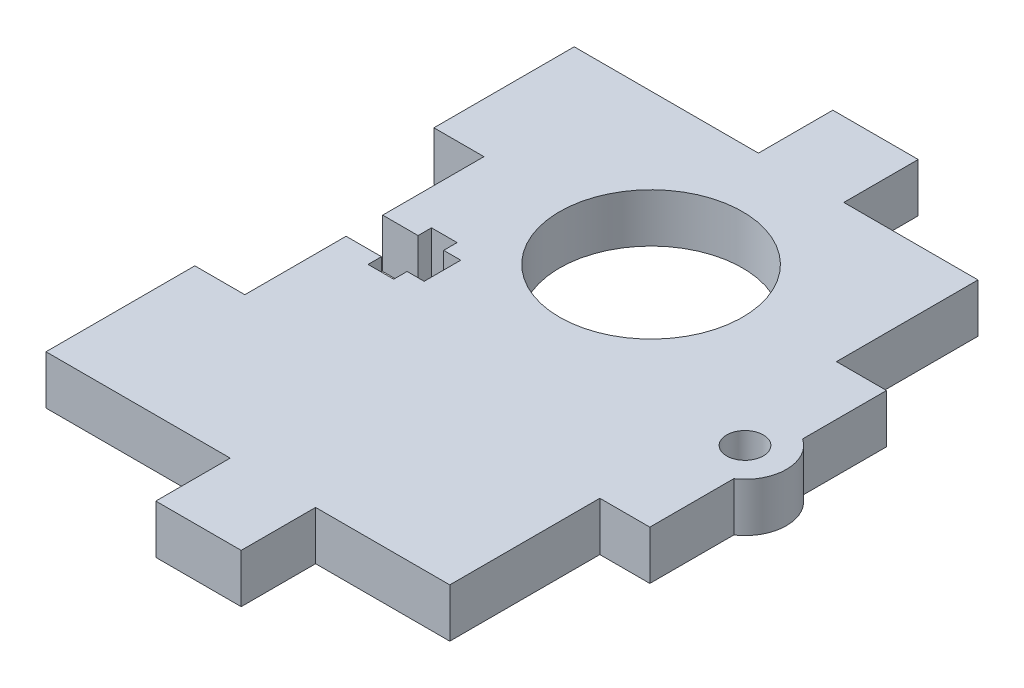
ISO-10303-21;
HEADER;
FILE_DESCRIPTION(('STEP AP214'),'2;1');
FILE_NAME('part.step','',(''),(''),'','','');
FILE_SCHEMA(('AUTOMOTIVE_DESIGN { 1 0 10303 214 1 1 1 1 }'));
ENDSEC;
DATA;
#1=APPLICATION_CONTEXT('core data for automotive mechanical design processes');
#2=APPLICATION_PROTOCOL_DEFINITION('international standard','automotive_design',2000,#1);
#3=PRODUCT_CONTEXT('',#1,'mechanical');
#4=PRODUCT('Part','Part','',(#3));
#5=PRODUCT_RELATED_PRODUCT_CATEGORY('part','',(#4));
#6=PRODUCT_DEFINITION_FORMATION('','',#4);
#7=PRODUCT_DEFINITION_CONTEXT('part definition',#1,'design');
#8=PRODUCT_DEFINITION('design','',#6,#7);
#9=PRODUCT_DEFINITION_SHAPE('','',#8);
#10=(LENGTH_UNIT() NAMED_UNIT(*) SI_UNIT(.MILLI.,.METRE.));
#11=(NAMED_UNIT(*) PLANE_ANGLE_UNIT() SI_UNIT($,.RADIAN.));
#12=(NAMED_UNIT(*) SI_UNIT($,.STERADIAN.) SOLID_ANGLE_UNIT());
#13=UNCERTAINTY_MEASURE_WITH_UNIT(LENGTH_MEASURE(1.E-05),#10,'distance_accuracy_value','');
#14=(GEOMETRIC_REPRESENTATION_CONTEXT(3) GLOBAL_UNCERTAINTY_ASSIGNED_CONTEXT((#13)) GLOBAL_UNIT_ASSIGNED_CONTEXT((#10,
#11,#12)) REPRESENTATION_CONTEXT('',''));
#15=CARTESIAN_POINT('',(0.,0.,0.));
#16=DIRECTION('',(0.,0.,1.));
#17=DIRECTION('',(1.,0.,0.));
#18=AXIS2_PLACEMENT_3D('',#15,#16,#17);
#19=CARTESIAN_POINT('',(-9.5,-2.,-2.6));
#20=DIRECTION('',(-1.,0.,0.));
#21=DIRECTION('',(0.,0.,1.));
#22=AXIS2_PLACEMENT_3D('',#19,#20,#21);
#23=PLANE('',#22);
#24=DIRECTION('',(0.,1.,0.));
#25=VECTOR('',#24,1.);
#26=CARTESIAN_POINT('',(-9.5,-2.,-2.6));
#27=LINE('',#26,#25);
#28=CARTESIAN_POINT('',(-9.5,-2.,-2.6));
#29=VERTEX_POINT('',#28);
#30=CARTESIAN_POINT('',(-9.5,2.,-2.6));
#31=VERTEX_POINT('',#30);
#32=EDGE_CURVE('E481',#29,#31,#27,.T.);
#33=ORIENTED_EDGE('',*,*,#32,.F.);
#34=DIRECTION('',(0.,0.,1.));
#35=VECTOR('',#34,1.);
#36=CARTESIAN_POINT('',(-9.5,-2.,-2.6));
#37=LINE('',#36,#35);
#38=CARTESIAN_POINT('',(-9.5,-2.,-1.5));
#39=VERTEX_POINT('',#38);
#40=EDGE_CURVE('E617',#29,#39,#37,.T.);
#41=ORIENTED_EDGE('',*,*,#40,.T.);
#42=DIRECTION('',(0.,1.,0.));
#43=VECTOR('',#42,1.);
#44=CARTESIAN_POINT('',(-9.5,-2.,-1.5));
#45=LINE('',#44,#43);
#46=CARTESIAN_POINT('',(-9.5,2.,-1.5));
#47=VERTEX_POINT('',#46);
#48=EDGE_CURVE('E607',#47,#39,#45,.F.);
#49=ORIENTED_EDGE('',*,*,#48,.F.);
#50=DIRECTION('',(0.,0.,1.));
#51=VECTOR('',#50,1.);
#52=CARTESIAN_POINT('',(-9.5,2.,0.));
#53=LINE('',#52,#51);
#54=EDGE_CURVE('E518',#31,#47,#53,.T.);
#55=ORIENTED_EDGE('',*,*,#54,.F.);
#56=EDGE_LOOP('',(#33,#41,#49,#55));
#57=FACE_BOUND('',#56,.T.);
#58=ADVANCED_FACE('F17',(#57),#23,.T.);
#59=CARTESIAN_POINT('',(-11.6,-2.,-1.5));
#60=DIRECTION('',(1.,0.,0.));
#61=DIRECTION('',(0.,0.,-1.));
#62=AXIS2_PLACEMENT_3D('',#59,#60,#61);
#63=PLANE('',#62);
#64=DIRECTION('',(0.,1.,0.));
#65=VECTOR('',#64,1.);
#66=CARTESIAN_POINT('',(-11.6,-2.,-1.5));
#67=LINE('',#66,#65);
#68=CARTESIAN_POINT('',(-11.6,-2.,-1.5));
#69=VERTEX_POINT('',#68);
#70=CARTESIAN_POINT('',(-11.6,2.,-1.5));
#71=VERTEX_POINT('',#70);
#72=EDGE_CURVE('E490',#69,#71,#67,.T.);
#73=ORIENTED_EDGE('',*,*,#72,.F.);
#74=DIRECTION('',(0.,0.,-1.));
#75=VECTOR('',#74,1.);
#76=CARTESIAN_POINT('',(-11.6,-2.,-1.5));
#77=LINE('',#76,#75);
#78=CARTESIAN_POINT('',(-11.6,-2.,-2.6));
#79=VERTEX_POINT('',#78);
#80=EDGE_CURVE('E614',#69,#79,#77,.T.);
#81=ORIENTED_EDGE('',*,*,#80,.T.);
#82=DIRECTION('',(0.,1.,0.));
#83=VECTOR('',#82,1.);
#84=CARTESIAN_POINT('',(-11.6,-2.,-2.6));
#85=LINE('',#84,#83);
#86=CARTESIAN_POINT('',(-11.6,2.,-2.6));
#87=VERTEX_POINT('',#86);
#88=EDGE_CURVE('E473',#87,#79,#85,.F.);
#89=ORIENTED_EDGE('',*,*,#88,.F.);
#90=DIRECTION('',(0.,0.,1.));
#91=VECTOR('',#90,1.);
#92=CARTESIAN_POINT('',(-11.6,2.,0.));
#93=LINE('',#92,#91);
#94=EDGE_CURVE('E521',#71,#87,#93,.F.);
#95=ORIENTED_EDGE('',*,*,#94,.F.);
#96=EDGE_LOOP('',(#73,#81,#89,#95));
#97=FACE_BOUND('',#96,.T.);
#98=ADVANCED_FACE('F1061',(#97),#63,.T.);
#99=CARTESIAN_POINT('',(-8.1,-2.,1.5));
#100=DIRECTION('',(0.,0.,-1.));
#101=DIRECTION('',(-1.,0.,0.));
#102=AXIS2_PLACEMENT_3D('',#99,#100,#101);
#103=PLANE('',#102);
#104=DIRECTION('',(0.,1.,0.));
#105=VECTOR('',#104,1.);
#106=CARTESIAN_POINT('',(-8.1,-2.,1.5));
#107=LINE('',#106,#105);
#108=CARTESIAN_POINT('',(-8.1,-2.,1.5));
#109=VERTEX_POINT('',#108);
#110=CARTESIAN_POINT('',(-8.1,2.,1.5));
#111=VERTEX_POINT('',#110);
#112=EDGE_CURVE('E470',#109,#111,#107,.T.);
#113=ORIENTED_EDGE('',*,*,#112,.F.);
#114=DIRECTION('',(-1.,0.,0.));
#115=VECTOR('',#114,1.);
#116=CARTESIAN_POINT('',(-8.1,-2.,1.5));
#117=LINE('',#116,#115);
#118=CARTESIAN_POINT('',(-9.5,-2.,1.5));
#119=VERTEX_POINT('',#118);
#120=EDGE_CURVE('E611',#109,#119,#117,.T.);
#121=ORIENTED_EDGE('',*,*,#120,.T.);
#122=DIRECTION('',(0.,1.,0.));
#123=VECTOR('',#122,1.);
#124=CARTESIAN_POINT('',(-9.5,-2.,1.5));
#125=LINE('',#124,#123);
#126=CARTESIAN_POINT('',(-9.5,2.,1.5));
#127=VERTEX_POINT('',#126);
#128=EDGE_CURVE('E600',#127,#119,#125,.F.);
#129=ORIENTED_EDGE('',*,*,#128,.F.);
#130=DIRECTION('',(1.,0.,0.));
#131=VECTOR('',#130,1.);
#132=CARTESIAN_POINT('',(0.,2.,1.5));
#133=LINE('',#132,#131);
#134=EDGE_CURVE('E512',#111,#127,#133,.F.);
#135=ORIENTED_EDGE('',*,*,#134,.F.);
#136=EDGE_LOOP('',(#113,#121,#129,#135));
#137=FACE_BOUND('',#136,.T.);
#138=ADVANCED_FACE('F1053',(#137),#103,.T.);
#139=CARTESIAN_POINT('',(-9.5,-2.,-1.5));
#140=DIRECTION('',(0.,0.,1.));
#141=DIRECTION('',(1.,0.,0.));
#142=AXIS2_PLACEMENT_3D('',#139,#140,#141);
#143=PLANE('',#142);
#144=ORIENTED_EDGE('',*,*,#48,.T.);
#145=DIRECTION('',(1.,0.,0.));
#146=VECTOR('',#145,1.);
#147=CARTESIAN_POINT('',(-9.5,-2.,-1.5));
#148=LINE('',#147,#146);
#149=CARTESIAN_POINT('',(-8.1,-2.,-1.5));
#150=VERTEX_POINT('',#149);
#151=EDGE_CURVE('E604',#39,#150,#148,.T.);
#152=ORIENTED_EDGE('',*,*,#151,.T.);
#153=DIRECTION('',(0.,1.,0.));
#154=VECTOR('',#153,1.);
#155=CARTESIAN_POINT('',(-8.1,-2.,-1.5));
#156=LINE('',#155,#154);
#157=CARTESIAN_POINT('',(-8.1,2.,-1.5));
#158=VERTEX_POINT('',#157);
#159=EDGE_CURVE('E461',#158,#150,#156,.F.);
#160=ORIENTED_EDGE('',*,*,#159,.F.);
#161=DIRECTION('',(1.,0.,0.));
#162=VECTOR('',#161,1.);
#163=CARTESIAN_POINT('',(0.,2.,-1.5));
#164=LINE('',#163,#162);
#165=EDGE_CURVE('E515',#47,#158,#164,.T.);
#166=ORIENTED_EDGE('',*,*,#165,.F.);
#167=EDGE_LOOP('',(#144,#152,#160,#166));
#168=FACE_BOUND('',#167,.T.);
#169=ADVANCED_FACE('F1045',(#168),#143,.T.);
#170=CARTESIAN_POINT('',(-9.5,-2.,1.5));
#171=DIRECTION('',(-1.,0.,0.));
#172=DIRECTION('',(0.,0.,1.));
#173=AXIS2_PLACEMENT_3D('',#170,#171,#172);
#174=PLANE('',#173);
#175=ORIENTED_EDGE('',*,*,#128,.T.);
#176=DIRECTION('',(0.,0.,1.));
#177=VECTOR('',#176,1.);
#178=CARTESIAN_POINT('',(-9.5,-2.,1.5));
#179=LINE('',#178,#177);
#180=CARTESIAN_POINT('',(-9.5,-2.,2.6));
#181=VERTEX_POINT('',#180);
#182=EDGE_CURVE('E591',#119,#181,#179,.T.);
#183=ORIENTED_EDGE('',*,*,#182,.T.);
#184=DIRECTION('',(0.,1.,0.));
#185=VECTOR('',#184,1.);
#186=CARTESIAN_POINT('',(-9.5,-2.,2.6));
#187=LINE('',#186,#185);
#188=CARTESIAN_POINT('',(-9.5,2.,2.6));
#189=VERTEX_POINT('',#188);
#190=EDGE_CURVE('E456',#189,#181,#187,.F.);
#191=ORIENTED_EDGE('',*,*,#190,.F.);
#192=DIRECTION('',(0.,0.,1.));
#193=VECTOR('',#192,1.);
#194=CARTESIAN_POINT('',(-9.5,2.,0.));
#195=LINE('',#194,#193);
#196=EDGE_CURVE('E509',#127,#189,#195,.T.);
#197=ORIENTED_EDGE('',*,*,#196,.F.);
#198=EDGE_LOOP('',(#175,#183,#191,#197));
#199=FACE_BOUND('',#198,.T.);
#200=ADVANCED_FACE('F1037',(#199),#174,.T.);
#201=CARTESIAN_POINT('',(-11.6,-2.,2.6));
#202=DIRECTION('',(1.,0.,0.));
#203=DIRECTION('',(0.,0.,-1.));
#204=AXIS2_PLACEMENT_3D('',#201,#202,#203);
#205=PLANE('',#204);
#206=DIRECTION('',(0.,1.,0.));
#207=VECTOR('',#206,1.);
#208=CARTESIAN_POINT('',(-11.6,-2.,2.6));
#209=LINE('',#208,#207);
#210=CARTESIAN_POINT('',(-11.6,-2.,2.6));
#211=VERTEX_POINT('',#210);
#212=CARTESIAN_POINT('',(-11.6,2.,2.6));
#213=VERTEX_POINT('',#212);
#214=EDGE_CURVE('E465',#211,#213,#209,.T.);
#215=ORIENTED_EDGE('',*,*,#214,.F.);
#216=DIRECTION('',(0.,0.,-1.));
#217=VECTOR('',#216,1.);
#218=CARTESIAN_POINT('',(-11.6,-2.,2.6));
#219=LINE('',#218,#217);
#220=CARTESIAN_POINT('',(-11.6,-2.,1.5));
#221=VERTEX_POINT('',#220);
#222=EDGE_CURVE('E523',#211,#221,#219,.T.);
#223=ORIENTED_EDGE('',*,*,#222,.T.);
#224=DIRECTION('',(0.,1.,0.));
#225=VECTOR('',#224,1.);
#226=CARTESIAN_POINT('',(-11.6,-2.,1.5));
#227=LINE('',#226,#225);
#228=CARTESIAN_POINT('',(-11.6,2.,1.5));
#229=VERTEX_POINT('',#228);
#230=EDGE_CURVE('E449',#229,#221,#227,.F.);
#231=ORIENTED_EDGE('',*,*,#230,.F.);
#232=DIRECTION('',(0.,0.,1.));
#233=VECTOR('',#232,1.);
#234=CARTESIAN_POINT('',(-11.6,2.,0.));
#235=LINE('',#234,#233);
#236=EDGE_CURVE('E508',#213,#229,#235,.F.);
#237=ORIENTED_EDGE('',*,*,#236,.F.);
#238=EDGE_LOOP('',(#215,#223,#231,#237));
#239=FACE_BOUND('',#238,.T.);
#240=ADVANCED_FACE('F1029',(#239),#205,.T.);
#241=CARTESIAN_POINT('',(0.,2.,0.));
#242=DIRECTION('',(0.,1.,0.));
#243=DIRECTION('',(0.,0.,1.));
#244=AXIS2_PLACEMENT_3D('',#241,#242,#243);
#245=PLANE('',#244);
#246=CARTESIAN_POINT('',(0.,2.,-9.));
#247=DIRECTION('',(0.,1.,0.));
#248=DIRECTION('',(0.,0.,1.));
#249=AXIS2_PLACEMENT_3D('',#246,#247,#248);
#250=CIRCLE('',#249,7.5);
#251=CARTESIAN_POINT('',(0.,2.,-1.5));
#252=VERTEX_POINT('',#251);
#253=EDGE_CURVE('E641',#252,#252,#250,.F.);
#254=ORIENTED_EDGE('',*,*,#253,.T.);
#255=EDGE_LOOP('',(#254));
#256=FACE_BOUND('',#255,.T.);
#257=CARTESIAN_POINT('',(16.7,2.,0.));
#258=DIRECTION('',(0.,1.,0.));
#259=DIRECTION('',(0.,0.,1.));
#260=AXIS2_PLACEMENT_3D('',#257,#258,#259);
#261=CIRCLE('',#260,1.5);
#262=CARTESIAN_POINT('',(16.7,2.,1.5));
#263=VERTEX_POINT('',#262);
#264=EDGE_CURVE('E645',#263,#263,#261,.F.);
#265=ORIENTED_EDGE('',*,*,#264,.T.);
#266=EDGE_LOOP('',(#265));
#267=FACE_BOUND('',#266,.T.);
#268=DIRECTION('',(-1.,0.,0.));
#269=VECTOR('',#268,1.);
#270=CARTESIAN_POINT('',(-3.5,2.,-21.3));
#271=LINE('',#270,#269);
#272=CARTESIAN_POINT('',(-18.6,2.,-21.3));
#273=VERTEX_POINT('',#272);
#274=CARTESIAN_POINT('',(-3.5,2.,-21.3));
#275=VERTEX_POINT('',#274);
#276=EDGE_CURVE('E653',#273,#275,#271,.F.);
#277=ORIENTED_EDGE('',*,*,#276,.F.);
#278=DIRECTION('',(0.,0.,1.));
#279=VECTOR('',#278,1.);
#280=CARTESIAN_POINT('',(-18.6,2.,-21.3));
#281=LINE('',#280,#279);
#282=CARTESIAN_POINT('',(-18.6,2.,-9.8));
#283=VERTEX_POINT('',#282);
#284=EDGE_CURVE('E505',#283,#273,#281,.F.);
#285=ORIENTED_EDGE('',*,*,#284,.F.);
#286=DIRECTION('',(1.,0.,0.));
#287=VECTOR('',#286,1.);
#288=CARTESIAN_POINT('',(-18.6,2.,-9.8));
#289=LINE('',#288,#287);
#290=CARTESIAN_POINT('',(-14.5,2.,-9.8));
#291=VERTEX_POINT('',#290);
#292=EDGE_CURVE('E502',#291,#283,#289,.F.);
#293=ORIENTED_EDGE('',*,*,#292,.F.);
#294=DIRECTION('',(0.,0.,1.));
#295=VECTOR('',#294,1.);
#296=CARTESIAN_POINT('',(-14.5,2.,-9.8));
#297=LINE('',#296,#295);
#298=CARTESIAN_POINT('',(-14.5,2.,-1.5));
#299=VERTEX_POINT('',#298);
#300=EDGE_CURVE('E496',#299,#291,#297,.F.);
#301=ORIENTED_EDGE('',*,*,#300,.F.);
#302=DIRECTION('',(1.,0.,0.));
#303=VECTOR('',#302,1.);
#304=CARTESIAN_POINT('',(-14.5,2.,-1.5));
#305=LINE('',#304,#303);
#306=EDGE_CURVE('E487',#71,#299,#305,.F.);
#307=ORIENTED_EDGE('',*,*,#306,.F.);
#308=ORIENTED_EDGE('',*,*,#94,.T.);
#309=DIRECTION('',(1.,0.,0.));
#310=VECTOR('',#309,1.);
#311=CARTESIAN_POINT('',(-11.6,2.,-2.6));
#312=LINE('',#311,#310);
#313=EDGE_CURVE('E477',#31,#87,#312,.F.);
#314=ORIENTED_EDGE('',*,*,#313,.F.);
#315=ORIENTED_EDGE('',*,*,#54,.T.);
#316=ORIENTED_EDGE('',*,*,#165,.T.);
#317=DIRECTION('',(0.,0.,1.));
#318=VECTOR('',#317,1.);
#319=CARTESIAN_POINT('',(-8.1,2.,-1.5));
#320=LINE('',#319,#318);
#321=EDGE_CURVE('E466',#111,#158,#320,.F.);
#322=ORIENTED_EDGE('',*,*,#321,.F.);
#323=ORIENTED_EDGE('',*,*,#134,.T.);
#324=ORIENTED_EDGE('',*,*,#196,.T.);
#325=DIRECTION('',(-1.,0.,0.));
#326=VECTOR('',#325,1.);
#327=CARTESIAN_POINT('',(-9.5,2.,2.6));
#328=LINE('',#327,#326);
#329=EDGE_CURVE('E460',#213,#189,#328,.F.);
#330=ORIENTED_EDGE('',*,*,#329,.F.);
#331=ORIENTED_EDGE('',*,*,#236,.T.);
#332=DIRECTION('',(-1.,0.,0.));
#333=VECTOR('',#332,1.);
#334=CARTESIAN_POINT('',(-11.6,2.,1.5));
#335=LINE('',#334,#333);
#336=CARTESIAN_POINT('',(-14.5,2.,1.5));
#337=VERTEX_POINT('',#336);
#338=EDGE_CURVE('E453',#337,#229,#335,.F.);
#339=ORIENTED_EDGE('',*,*,#338,.F.);
#340=DIRECTION('',(0.,0.,1.));
#341=VECTOR('',#340,1.);
#342=CARTESIAN_POINT('',(-14.5,2.,1.5));
#343=LINE('',#342,#341);
#344=CARTESIAN_POINT('',(-14.5,2.,9.8));
#345=VERTEX_POINT('',#344);
#346=EDGE_CURVE('E440',#345,#337,#343,.F.);
#347=ORIENTED_EDGE('',*,*,#346,.F.);
#348=DIRECTION('',(-1.,0.,0.));
#349=VECTOR('',#348,1.);
#350=CARTESIAN_POINT('',(-14.5,2.,9.8));
#351=LINE('',#350,#349);
#352=CARTESIAN_POINT('',(-18.6,2.,9.8));
#353=VERTEX_POINT('',#352);
#354=EDGE_CURVE('E428',#353,#345,#351,.F.);
#355=ORIENTED_EDGE('',*,*,#354,.F.);
#356=DIRECTION('',(0.,0.,1.));
#357=VECTOR('',#356,1.);
#358=CARTESIAN_POINT('',(-18.6,2.,9.8));
#359=LINE('',#358,#357);
#360=CARTESIAN_POINT('',(-18.6,2.,22.));
#361=VERTEX_POINT('',#360);
#362=EDGE_CURVE('E416',#361,#353,#359,.F.);
#363=ORIENTED_EDGE('',*,*,#362,.F.);
#364=DIRECTION('',(1.,0.,0.));
#365=VECTOR('',#364,1.);
#366=CARTESIAN_POINT('',(-18.6,2.,22.));
#367=LINE('',#366,#365);
#368=CARTESIAN_POINT('',(-3.5,2.,22.));
#369=VERTEX_POINT('',#368);
#370=EDGE_CURVE('E404',#369,#361,#367,.F.);
#371=ORIENTED_EDGE('',*,*,#370,.F.);
#372=DIRECTION('',(0.,0.,1.));
#373=VECTOR('',#372,1.);
#374=CARTESIAN_POINT('',(-3.5,2.,22.));
#375=LINE('',#374,#373);
#376=CARTESIAN_POINT('',(-3.5,2.,28.1));
#377=VERTEX_POINT('',#376);
#378=EDGE_CURVE('E392',#377,#369,#375,.F.);
#379=ORIENTED_EDGE('',*,*,#378,.F.);
#380=DIRECTION('',(1.,0.,0.));
#381=VECTOR('',#380,1.);
#382=CARTESIAN_POINT('',(-3.5,2.,28.1));
#383=LINE('',#382,#381);
#384=CARTESIAN_POINT('',(3.5,2.,28.1));
#385=VERTEX_POINT('',#384);
#386=EDGE_CURVE('E380',#385,#377,#383,.F.);
#387=ORIENTED_EDGE('',*,*,#386,.F.);
#388=DIRECTION('',(0.,0.,-1.));
#389=VECTOR('',#388,1.);
#390=CARTESIAN_POINT('',(3.5,2.,28.1));
#391=LINE('',#390,#389);
#392=CARTESIAN_POINT('',(3.5,2.,22.));
#393=VERTEX_POINT('',#392);
#394=EDGE_CURVE('E368',#393,#385,#391,.F.);
#395=ORIENTED_EDGE('',*,*,#394,.F.);
#396=DIRECTION('',(1.,0.,0.));
#397=VECTOR('',#396,1.);
#398=CARTESIAN_POINT('',(3.5,2.,22.));
#399=LINE('',#398,#397);
#400=CARTESIAN_POINT('',(14.5,2.,22.));
#401=VERTEX_POINT('',#400);
#402=EDGE_CURVE('E358',#401,#393,#399,.F.);
#403=ORIENTED_EDGE('',*,*,#402,.F.);
#404=DIRECTION('',(0.,0.,-1.));
#405=VECTOR('',#404,1.);
#406=CARTESIAN_POINT('',(14.5,2.,22.));
#407=LINE('',#406,#405);
#408=CARTESIAN_POINT('',(14.5,2.,9.7));
#409=VERTEX_POINT('',#408);
#410=EDGE_CURVE('E347',#409,#401,#407,.F.);
#411=ORIENTED_EDGE('',*,*,#410,.F.);
#412=DIRECTION('',(1.,0.,0.));
#413=VECTOR('',#412,1.);
#414=CARTESIAN_POINT('',(14.5,2.,9.7));
#415=LINE('',#414,#413);
#416=CARTESIAN_POINT('',(18.6,2.,9.7));
#417=VERTEX_POINT('',#416);
#418=EDGE_CURVE('E312',#417,#409,#415,.F.);
#419=ORIENTED_EDGE('',*,*,#418,.F.);
#420=DIRECTION('',(0.,0.,-1.));
#421=VECTOR('',#420,1.);
#422=CARTESIAN_POINT('',(18.6,2.,9.7));
#423=LINE('',#422,#421);
#424=CARTESIAN_POINT('',(18.6000000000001,2.,2.81957443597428));
#425=VERTEX_POINT('',#424);
#426=EDGE_CURVE('E308',#425,#417,#423,.F.);
#427=ORIENTED_EDGE('',*,*,#426,.F.);
#428=CARTESIAN_POINT('',(16.7,2.,0.));
#429=DIRECTION('',(0.,1.,0.));
#430=DIRECTION('',(0.,0.,1.));
#431=AXIS2_PLACEMENT_3D('',#428,#429,#430);
#432=CIRCLE('',#431,3.4);
#433=CARTESIAN_POINT('',(18.6,2.,-2.81957443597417));
#434=VERTEX_POINT('',#433);
#435=EDGE_CURVE('E20',#434,#425,#432,.F.);
#436=ORIENTED_EDGE('',*,*,#435,.F.);
#437=DIRECTION('',(0.,0.,-1.));
#438=VECTOR('',#437,1.);
#439=CARTESIAN_POINT('',(18.6,2.,-2.819574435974));
#440=LINE('',#439,#438);
#441=CARTESIAN_POINT('',(18.6,2.,-9.7));
#442=VERTEX_POINT('',#441);
#443=EDGE_CURVE('E292',#442,#434,#440,.F.);
#444=ORIENTED_EDGE('',*,*,#443,.F.);
#445=DIRECTION('',(-1.,0.,0.));
#446=VECTOR('',#445,1.);
#447=CARTESIAN_POINT('',(18.6,2.,-9.7));
#448=LINE('',#447,#446);
#449=CARTESIAN_POINT('',(14.5,2.,-9.7));
#450=VERTEX_POINT('',#449);
#451=EDGE_CURVE('E527',#450,#442,#448,.F.);
#452=ORIENTED_EDGE('',*,*,#451,.F.);
#453=DIRECTION('',(0.,0.,-1.));
#454=VECTOR('',#453,1.);
#455=CARTESIAN_POINT('',(14.5,2.,-9.7));
#456=LINE('',#455,#454);
#457=CARTESIAN_POINT('',(14.5,2.,-21.3));
#458=VERTEX_POINT('',#457);
#459=EDGE_CURVE('E533',#458,#450,#456,.F.);
#460=ORIENTED_EDGE('',*,*,#459,.F.);
#461=DIRECTION('',(-1.,0.,0.));
#462=VECTOR('',#461,1.);
#463=CARTESIAN_POINT('',(14.5,2.,-21.3));
#464=LINE('',#463,#462);
#465=CARTESIAN_POINT('',(3.5,2.,-21.3));
#466=VERTEX_POINT('',#465);
#467=EDGE_CURVE('E541',#466,#458,#464,.F.);
#468=ORIENTED_EDGE('',*,*,#467,.F.);
#469=DIRECTION('',(0.,0.,-1.));
#470=VECTOR('',#469,1.);
#471=CARTESIAN_POINT('',(3.5,2.,-21.3));
#472=LINE('',#471,#470);
#473=CARTESIAN_POINT('',(3.5,2.,-27.4));
#474=VERTEX_POINT('',#473);
#475=EDGE_CURVE('E680',#474,#466,#472,.F.);
#476=ORIENTED_EDGE('',*,*,#475,.F.);
#477=DIRECTION('',(-1.,0.,0.));
#478=VECTOR('',#477,1.);
#479=CARTESIAN_POINT('',(3.5,2.,-27.4));
#480=LINE('',#479,#478);
#481=CARTESIAN_POINT('',(-3.5,2.,-27.4));
#482=VERTEX_POINT('',#481);
#483=EDGE_CURVE('E674',#482,#474,#480,.F.);
#484=ORIENTED_EDGE('',*,*,#483,.F.);
#485=DIRECTION('',(0.,0.,1.));
#486=VECTOR('',#485,1.);
#487=CARTESIAN_POINT('',(-3.5,2.,-27.4));
#488=LINE('',#487,#486);
#489=EDGE_CURVE('E669',#275,#482,#488,.F.);
#490=ORIENTED_EDGE('',*,*,#489,.F.);
#491=EDGE_LOOP('',(#277,#285,#293,#301,#307,#308,#314,#315,#316,#322,#323,#324,#330,#331,#339,
#347,#355,#363,#371,#379,#387,#395,#403,#411,#419,#427,#436,#444,#452,#460,#468,#476,#484,#490));
#492=FACE_BOUND('',#491,.T.);
#493=ADVANCED_FACE('F310',(#256,#267,#492),#245,.T.);
#494=CARTESIAN_POINT('',(-18.6,-2.,-21.3));
#495=DIRECTION('',(-1.,0.,0.));
#496=DIRECTION('',(0.,0.,1.));
#497=AXIS2_PLACEMENT_3D('',#494,#495,#496);
#498=PLANE('',#497);
#499=DIRECTION('',(0.,1.,0.));
#500=VECTOR('',#499,1.);
#501=CARTESIAN_POINT('',(-18.6,-2.,-21.3));
#502=LINE('',#501,#500);
#503=CARTESIAN_POINT('',(-18.6,-2.,-21.3));
#504=VERTEX_POINT('',#503);
#505=EDGE_CURVE('E658',#504,#273,#502,.T.);
#506=ORIENTED_EDGE('',*,*,#505,.F.);
#507=DIRECTION('',(0.,0.,1.));
#508=VECTOR('',#507,1.);
#509=CARTESIAN_POINT('',(-18.6,-2.,0.));
#510=LINE('',#509,#508);
#511=CARTESIAN_POINT('',(-18.6,-2.,-9.8));
#512=VERTEX_POINT('',#511);
#513=EDGE_CURVE('E644',#504,#512,#510,.T.);
#514=ORIENTED_EDGE('',*,*,#513,.T.);
#515=DIRECTION('',(0.,1.,0.));
#516=VECTOR('',#515,1.);
#517=CARTESIAN_POINT('',(-18.6,-2.,-9.8));
#518=LINE('',#517,#516);
#519=EDGE_CURVE('E499',#283,#512,#518,.F.);
#520=ORIENTED_EDGE('',*,*,#519,.F.);
#521=ORIENTED_EDGE('',*,*,#284,.T.);
#522=EDGE_LOOP('',(#506,#514,#520,#521));
#523=FACE_BOUND('',#522,.T.);
#524=ADVANCED_FACE('F744',(#523),#498,.T.);
#525=CARTESIAN_POINT('',(-18.6,-2.,-9.8));
#526=DIRECTION('',(0.,0.,1.));
#527=DIRECTION('',(1.,0.,0.));
#528=AXIS2_PLACEMENT_3D('',#525,#526,#527);
#529=PLANE('',#528);
#530=ORIENTED_EDGE('',*,*,#519,.T.);
#531=DIRECTION('',(1.,0.,0.));
#532=VECTOR('',#531,1.);
#533=CARTESIAN_POINT('',(0.,-2.,-9.8));
#534=LINE('',#533,#532);
#535=CARTESIAN_POINT('',(-14.5,-2.,-9.8));
#536=VERTEX_POINT('',#535);
#537=EDGE_CURVE('E733',#512,#536,#534,.T.);
#538=ORIENTED_EDGE('',*,*,#537,.T.);
#539=DIRECTION('',(0.,1.,0.));
#540=VECTOR('',#539,1.);
#541=CARTESIAN_POINT('',(-14.5,-2.,-9.8));
#542=LINE('',#541,#540);
#543=EDGE_CURVE('E493',#291,#536,#542,.F.);
#544=ORIENTED_EDGE('',*,*,#543,.F.);
#545=ORIENTED_EDGE('',*,*,#292,.T.);
#546=EDGE_LOOP('',(#530,#538,#544,#545));
#547=FACE_BOUND('',#546,.T.);
#548=ADVANCED_FACE('F753',(#547),#529,.T.);
#549=CARTESIAN_POINT('',(-14.5,-2.,-9.8));
#550=DIRECTION('',(-1.,0.,0.));
#551=DIRECTION('',(0.,0.,1.));
#552=AXIS2_PLACEMENT_3D('',#549,#550,#551);
#553=PLANE('',#552);
#554=ORIENTED_EDGE('',*,*,#543,.T.);
#555=DIRECTION('',(0.,0.,1.));
#556=VECTOR('',#555,1.);
#557=CARTESIAN_POINT('',(-14.5,-2.,0.));
#558=LINE('',#557,#556);
#559=CARTESIAN_POINT('',(-14.5,-2.,-1.5));
#560=VERTEX_POINT('',#559);
#561=EDGE_CURVE('E730',#536,#560,#558,.T.);
#562=ORIENTED_EDGE('',*,*,#561,.T.);
#563=DIRECTION('',(0.,1.,0.));
#564=VECTOR('',#563,1.);
#565=CARTESIAN_POINT('',(-14.5,-2.,-1.5));
#566=LINE('',#565,#564);
#567=EDGE_CURVE('E484',#299,#560,#566,.F.);
#568=ORIENTED_EDGE('',*,*,#567,.F.);
#569=ORIENTED_EDGE('',*,*,#300,.T.);
#570=EDGE_LOOP('',(#554,#562,#568,#569));
#571=FACE_BOUND('',#570,.T.);
#572=ADVANCED_FACE('F750',(#571),#553,.T.);
#573=CARTESIAN_POINT('',(-14.5,-2.,-1.5));
#574=DIRECTION('',(0.,0.,1.));
#575=DIRECTION('',(1.,0.,0.));
#576=AXIS2_PLACEMENT_3D('',#573,#574,#575);
#577=PLANE('',#576);
#578=ORIENTED_EDGE('',*,*,#567,.T.);
#579=DIRECTION('',(1.,0.,0.));
#580=VECTOR('',#579,1.);
#581=CARTESIAN_POINT('',(0.,-2.,-1.5));
#582=LINE('',#581,#580);
#583=EDGE_CURVE('E726',#560,#69,#582,.T.);
#584=ORIENTED_EDGE('',*,*,#583,.T.);
#585=ORIENTED_EDGE('',*,*,#72,.T.);
#586=ORIENTED_EDGE('',*,*,#306,.T.);
#587=EDGE_LOOP('',(#578,#584,#585,#586));
#588=FACE_BOUND('',#587,.T.);
#589=ADVANCED_FACE('F996',(#588),#577,.T.);
#590=CARTESIAN_POINT('',(-11.6,-2.,-2.6));
#591=DIRECTION('',(0.,0.,1.));
#592=DIRECTION('',(1.,0.,0.));
#593=AXIS2_PLACEMENT_3D('',#590,#591,#592);
#594=PLANE('',#593);
#595=ORIENTED_EDGE('',*,*,#88,.T.);
#596=DIRECTION('',(1.,0.,0.));
#597=VECTOR('',#596,1.);
#598=CARTESIAN_POINT('',(0.,-2.,-2.6));
#599=LINE('',#598,#597);
#600=EDGE_CURVE('E722',#79,#29,#599,.T.);
#601=ORIENTED_EDGE('',*,*,#600,.T.);
#602=ORIENTED_EDGE('',*,*,#32,.T.);
#603=ORIENTED_EDGE('',*,*,#313,.T.);
#604=EDGE_LOOP('',(#595,#601,#602,#603));
#605=FACE_BOUND('',#604,.T.);
#606=ADVANCED_FACE('F988',(#605),#594,.T.);
#607=CARTESIAN_POINT('',(-8.1,-2.,-1.5));
#608=DIRECTION('',(-1.,0.,0.));
#609=DIRECTION('',(0.,0.,1.));
#610=AXIS2_PLACEMENT_3D('',#607,#608,#609);
#611=PLANE('',#610);
#612=ORIENTED_EDGE('',*,*,#159,.T.);
#613=DIRECTION('',(0.,0.,1.));
#614=VECTOR('',#613,1.);
#615=CARTESIAN_POINT('',(-8.1,-2.,0.));
#616=LINE('',#615,#614);
#617=EDGE_CURVE('E632',#150,#109,#616,.T.);
#618=ORIENTED_EDGE('',*,*,#617,.T.);
#619=ORIENTED_EDGE('',*,*,#112,.T.);
#620=ORIENTED_EDGE('',*,*,#321,.T.);
#621=EDGE_LOOP('',(#612,#618,#619,#620));
#622=FACE_BOUND('',#621,.T.);
#623=ADVANCED_FACE('F980',(#622),#611,.T.);
#624=CARTESIAN_POINT('',(-9.5,-2.,2.6));
#625=DIRECTION('',(0.,0.,-1.));
#626=DIRECTION('',(-1.,0.,0.));
#627=AXIS2_PLACEMENT_3D('',#624,#625,#626);
#628=PLANE('',#627);
#629=ORIENTED_EDGE('',*,*,#190,.T.);
#630=DIRECTION('',(1.,0.,0.));
#631=VECTOR('',#630,1.);
#632=CARTESIAN_POINT('',(0.,-2.,2.6));
#633=LINE('',#632,#631);
#634=EDGE_CURVE('E446',#181,#211,#633,.F.);
#635=ORIENTED_EDGE('',*,*,#634,.T.);
#636=ORIENTED_EDGE('',*,*,#214,.T.);
#637=ORIENTED_EDGE('',*,*,#329,.T.);
#638=EDGE_LOOP('',(#629,#635,#636,#637));
#639=FACE_BOUND('',#638,.T.);
#640=ADVANCED_FACE('F972',(#639),#628,.T.);
#641=CARTESIAN_POINT('',(-11.6,-2.,1.5));
#642=DIRECTION('',(0.,0.,-1.));
#643=DIRECTION('',(-1.,0.,0.));
#644=AXIS2_PLACEMENT_3D('',#641,#642,#643);
#645=PLANE('',#644);
#646=ORIENTED_EDGE('',*,*,#230,.T.);
#647=DIRECTION('',(1.,0.,0.));
#648=VECTOR('',#647,1.);
#649=CARTESIAN_POINT('',(0.,-2.,1.5));
#650=LINE('',#649,#648);
#651=CARTESIAN_POINT('',(-14.5,-2.,1.5));
#652=VERTEX_POINT('',#651);
#653=EDGE_CURVE('E434',#221,#652,#650,.F.);
#654=ORIENTED_EDGE('',*,*,#653,.T.);
#655=DIRECTION('',(0.,1.,0.));
#656=VECTOR('',#655,1.);
#657=CARTESIAN_POINT('',(-14.5,-2.,1.5));
#658=LINE('',#657,#656);
#659=EDGE_CURVE('E437',#337,#652,#658,.F.);
#660=ORIENTED_EDGE('',*,*,#659,.F.);
#661=ORIENTED_EDGE('',*,*,#338,.T.);
#662=EDGE_LOOP('',(#646,#654,#660,#661));
#663=FACE_BOUND('',#662,.T.);
#664=ADVANCED_FACE('F964',(#663),#645,.T.);
#665=CARTESIAN_POINT('',(-14.5,-2.,1.5));
#666=DIRECTION('',(-1.,0.,0.));
#667=DIRECTION('',(0.,0.,1.));
#668=AXIS2_PLACEMENT_3D('',#665,#666,#667);
#669=PLANE('',#668);
#670=ORIENTED_EDGE('',*,*,#659,.T.);
#671=DIRECTION('',(0.,0.,1.));
#672=VECTOR('',#671,1.);
#673=CARTESIAN_POINT('',(-14.5,-2.,0.));
#674=LINE('',#673,#672);
#675=CARTESIAN_POINT('',(-14.5,-2.,9.8));
#676=VERTEX_POINT('',#675);
#677=EDGE_CURVE('E422',#652,#676,#674,.T.);
#678=ORIENTED_EDGE('',*,*,#677,.T.);
#679=DIRECTION('',(0.,1.,0.));
#680=VECTOR('',#679,1.);
#681=CARTESIAN_POINT('',(-14.5,-2.,9.8));
#682=LINE('',#681,#680);
#683=EDGE_CURVE('E425',#345,#676,#682,.F.);
#684=ORIENTED_EDGE('',*,*,#683,.F.);
#685=ORIENTED_EDGE('',*,*,#346,.T.);
#686=EDGE_LOOP('',(#670,#678,#684,#685));
#687=FACE_BOUND('',#686,.T.);
#688=ADVANCED_FACE('F956',(#687),#669,.T.);
#689=CARTESIAN_POINT('',(-14.5,-2.,9.8));
#690=DIRECTION('',(0.,0.,-1.));
#691=DIRECTION('',(-1.,0.,0.));
#692=AXIS2_PLACEMENT_3D('',#689,#690,#691);
#693=PLANE('',#692);
#694=ORIENTED_EDGE('',*,*,#683,.T.);
#695=DIRECTION('',(1.,0.,0.));
#696=VECTOR('',#695,1.);
#697=CARTESIAN_POINT('',(0.,-2.,9.8));
#698=LINE('',#697,#696);
#699=CARTESIAN_POINT('',(-18.6,-2.,9.8));
#700=VERTEX_POINT('',#699);
#701=EDGE_CURVE('E410',#676,#700,#698,.F.);
#702=ORIENTED_EDGE('',*,*,#701,.T.);
#703=DIRECTION('',(0.,1.,0.));
#704=VECTOR('',#703,1.);
#705=CARTESIAN_POINT('',(-18.6,-2.,9.8));
#706=LINE('',#705,#704);
#707=EDGE_CURVE('E413',#353,#700,#706,.F.);
#708=ORIENTED_EDGE('',*,*,#707,.F.);
#709=ORIENTED_EDGE('',*,*,#354,.T.);
#710=EDGE_LOOP('',(#694,#702,#708,#709));
#711=FACE_BOUND('',#710,.T.);
#712=ADVANCED_FACE('F948',(#711),#693,.T.);
#713=CARTESIAN_POINT('',(-18.6,-2.,9.8));
#714=DIRECTION('',(-1.,0.,0.));
#715=DIRECTION('',(0.,0.,1.));
#716=AXIS2_PLACEMENT_3D('',#713,#714,#715);
#717=PLANE('',#716);
#718=ORIENTED_EDGE('',*,*,#707,.T.);
#719=DIRECTION('',(0.,0.,1.));
#720=VECTOR('',#719,1.);
#721=CARTESIAN_POINT('',(-18.6,-2.,0.));
#722=LINE('',#721,#720);
#723=CARTESIAN_POINT('',(-18.6,-2.,22.));
#724=VERTEX_POINT('',#723);
#725=EDGE_CURVE('E398',#700,#724,#722,.T.);
#726=ORIENTED_EDGE('',*,*,#725,.T.);
#727=DIRECTION('',(0.,1.,0.));
#728=VECTOR('',#727,1.);
#729=CARTESIAN_POINT('',(-18.6,-2.,22.));
#730=LINE('',#729,#728);
#731=EDGE_CURVE('E401',#361,#724,#730,.F.);
#732=ORIENTED_EDGE('',*,*,#731,.F.);
#733=ORIENTED_EDGE('',*,*,#362,.T.);
#734=EDGE_LOOP('',(#718,#726,#732,#733));
#735=FACE_BOUND('',#734,.T.);
#736=ADVANCED_FACE('F940',(#735),#717,.T.);
#737=CARTESIAN_POINT('',(-18.6,-2.,22.));
#738=DIRECTION('',(0.,0.,1.));
#739=DIRECTION('',(1.,0.,0.));
#740=AXIS2_PLACEMENT_3D('',#737,#738,#739);
#741=PLANE('',#740);
#742=ORIENTED_EDGE('',*,*,#731,.T.);
#743=DIRECTION('',(1.,0.,0.));
#744=VECTOR('',#743,1.);
#745=CARTESIAN_POINT('',(0.,-2.,22.));
#746=LINE('',#745,#744);
#747=CARTESIAN_POINT('',(-3.5,-2.,22.));
#748=VERTEX_POINT('',#747);
#749=EDGE_CURVE('E386',#724,#748,#746,.T.);
#750=ORIENTED_EDGE('',*,*,#749,.T.);
#751=DIRECTION('',(0.,1.,0.));
#752=VECTOR('',#751,1.);
#753=CARTESIAN_POINT('',(-3.5,-2.,22.));
#754=LINE('',#753,#752);
#755=EDGE_CURVE('E389',#369,#748,#754,.F.);
#756=ORIENTED_EDGE('',*,*,#755,.F.);
#757=ORIENTED_EDGE('',*,*,#370,.T.);
#758=EDGE_LOOP('',(#742,#750,#756,#757));
#759=FACE_BOUND('',#758,.T.);
#760=ADVANCED_FACE('F932',(#759),#741,.T.);
#761=CARTESIAN_POINT('',(-3.5,-2.,22.));
#762=DIRECTION('',(-1.,0.,0.));
#763=DIRECTION('',(0.,0.,1.));
#764=AXIS2_PLACEMENT_3D('',#761,#762,#763);
#765=PLANE('',#764);
#766=ORIENTED_EDGE('',*,*,#755,.T.);
#767=DIRECTION('',(0.,0.,1.));
#768=VECTOR('',#767,1.);
#769=CARTESIAN_POINT('',(-3.5,-2.,0.));
#770=LINE('',#769,#768);
#771=CARTESIAN_POINT('',(-3.5,-2.,28.1));
#772=VERTEX_POINT('',#771);
#773=EDGE_CURVE('E374',#748,#772,#770,.T.);
#774=ORIENTED_EDGE('',*,*,#773,.T.);
#775=DIRECTION('',(0.,1.,0.));
#776=VECTOR('',#775,1.);
#777=CARTESIAN_POINT('',(-3.5,-2.,28.1));
#778=LINE('',#777,#776);
#779=EDGE_CURVE('E377',#377,#772,#778,.F.);
#780=ORIENTED_EDGE('',*,*,#779,.F.);
#781=ORIENTED_EDGE('',*,*,#378,.T.);
#782=EDGE_LOOP('',(#766,#774,#780,#781));
#783=FACE_BOUND('',#782,.T.);
#784=ADVANCED_FACE('F924',(#783),#765,.T.);
#785=CARTESIAN_POINT('',(-3.5,-2.,28.1));
#786=DIRECTION('',(0.,0.,1.));
#787=DIRECTION('',(1.,0.,0.));
#788=AXIS2_PLACEMENT_3D('',#785,#786,#787);
#789=PLANE('',#788);
#790=ORIENTED_EDGE('',*,*,#779,.T.);
#791=DIRECTION('',(1.,0.,0.));
#792=VECTOR('',#791,1.);
#793=CARTESIAN_POINT('',(0.,-2.,28.1));
#794=LINE('',#793,#792);
#795=CARTESIAN_POINT('',(3.5,-2.,28.1));
#796=VERTEX_POINT('',#795);
#797=EDGE_CURVE('E363',#772,#796,#794,.T.);
#798=ORIENTED_EDGE('',*,*,#797,.T.);
#799=DIRECTION('',(0.,1.,0.));
#800=VECTOR('',#799,1.);
#801=CARTESIAN_POINT('',(3.5,-2.,28.1));
#802=LINE('',#801,#800);
#803=EDGE_CURVE('E366',#385,#796,#802,.F.);
#804=ORIENTED_EDGE('',*,*,#803,.F.);
#805=ORIENTED_EDGE('',*,*,#386,.T.);
#806=EDGE_LOOP('',(#790,#798,#804,#805));
#807=FACE_BOUND('',#806,.T.);
#808=ADVANCED_FACE('F916',(#807),#789,.T.);
#809=CARTESIAN_POINT('',(3.5,-2.,28.1));
#810=DIRECTION('',(1.,0.,0.));
#811=DIRECTION('',(0.,0.,-1.));
#812=AXIS2_PLACEMENT_3D('',#809,#810,#811);
#813=PLANE('',#812);
#814=ORIENTED_EDGE('',*,*,#803,.T.);
#815=DIRECTION('',(0.,0.,1.));
#816=VECTOR('',#815,1.);
#817=CARTESIAN_POINT('',(3.5,-2.,0.));
#818=LINE('',#817,#816);
#819=CARTESIAN_POINT('',(3.5,-2.,22.));
#820=VERTEX_POINT('',#819);
#821=EDGE_CURVE('E352',#796,#820,#818,.F.);
#822=ORIENTED_EDGE('',*,*,#821,.T.);
#823=DIRECTION('',(0.,1.,0.));
#824=VECTOR('',#823,1.);
#825=CARTESIAN_POINT('',(3.5,-2.,22.));
#826=LINE('',#825,#824);
#827=EDGE_CURVE('E355',#393,#820,#826,.F.);
#828=ORIENTED_EDGE('',*,*,#827,.F.);
#829=ORIENTED_EDGE('',*,*,#394,.T.);
#830=EDGE_LOOP('',(#814,#822,#828,#829));
#831=FACE_BOUND('',#830,.T.);
#832=ADVANCED_FACE('F908',(#831),#813,.T.);
#833=CARTESIAN_POINT('',(3.5,-2.,22.));
#834=DIRECTION('',(0.,0.,1.));
#835=DIRECTION('',(1.,0.,0.));
#836=AXIS2_PLACEMENT_3D('',#833,#834,#835);
#837=PLANE('',#836);
#838=ORIENTED_EDGE('',*,*,#827,.T.);
#839=DIRECTION('',(1.,0.,0.));
#840=VECTOR('',#839,1.);
#841=CARTESIAN_POINT('',(0.,-2.,22.));
#842=LINE('',#841,#840);
#843=CARTESIAN_POINT('',(14.5,-2.,22.));
#844=VERTEX_POINT('',#843);
#845=EDGE_CURVE('E342',#820,#844,#842,.T.);
#846=ORIENTED_EDGE('',*,*,#845,.T.);
#847=DIRECTION('',(0.,1.,0.));
#848=VECTOR('',#847,1.);
#849=CARTESIAN_POINT('',(14.5,-2.,22.));
#850=LINE('',#849,#848);
#851=EDGE_CURVE('E345',#401,#844,#850,.F.);
#852=ORIENTED_EDGE('',*,*,#851,.F.);
#853=ORIENTED_EDGE('',*,*,#402,.T.);
#854=EDGE_LOOP('',(#838,#846,#852,#853));
#855=FACE_BOUND('',#854,.T.);
#856=ADVANCED_FACE('F900',(#855),#837,.T.);
#857=CARTESIAN_POINT('',(14.5,-2.,22.));
#858=DIRECTION('',(1.,0.,0.));
#859=DIRECTION('',(0.,0.,-1.));
#860=AXIS2_PLACEMENT_3D('',#857,#858,#859);
#861=PLANE('',#860);
#862=ORIENTED_EDGE('',*,*,#851,.T.);
#863=DIRECTION('',(0.,0.,1.));
#864=VECTOR('',#863,1.);
#865=CARTESIAN_POINT('',(14.5,-2.,0.));
#866=LINE('',#865,#864);
#867=CARTESIAN_POINT('',(14.5,-2.,9.7));
#868=VERTEX_POINT('',#867);
#869=EDGE_CURVE('E334',#844,#868,#866,.F.);
#870=ORIENTED_EDGE('',*,*,#869,.T.);
#871=DIRECTION('',(0.,1.,0.));
#872=VECTOR('',#871,1.);
#873=CARTESIAN_POINT('',(14.5,-2.,9.7));
#874=LINE('',#873,#872);
#875=EDGE_CURVE('E315',#409,#868,#874,.F.);
#876=ORIENTED_EDGE('',*,*,#875,.F.);
#877=ORIENTED_EDGE('',*,*,#410,.T.);
#878=EDGE_LOOP('',(#862,#870,#876,#877));
#879=FACE_BOUND('',#878,.T.);
#880=ADVANCED_FACE('F892',(#879),#861,.T.);
#881=CARTESIAN_POINT('',(14.5,-2.,9.7));
#882=DIRECTION('',(0.,0.,1.));
#883=DIRECTION('',(1.,0.,0.));
#884=AXIS2_PLACEMENT_3D('',#881,#882,#883);
#885=PLANE('',#884);
#886=ORIENTED_EDGE('',*,*,#875,.T.);
#887=DIRECTION('',(1.,0.,0.));
#888=VECTOR('',#887,1.);
#889=CARTESIAN_POINT('',(0.,-2.,9.7));
#890=LINE('',#889,#888);
#891=CARTESIAN_POINT('',(18.6,-2.,9.7));
#892=VERTEX_POINT('',#891);
#893=EDGE_CURVE('E331',#868,#892,#890,.T.);
#894=ORIENTED_EDGE('',*,*,#893,.T.);
#895=DIRECTION('',(0.,1.,0.));
#896=VECTOR('',#895,1.);
#897=CARTESIAN_POINT('',(18.6,-2.,9.7));
#898=LINE('',#897,#896);
#899=EDGE_CURVE('E306',#417,#892,#898,.F.);
#900=ORIENTED_EDGE('',*,*,#899,.F.);
#901=ORIENTED_EDGE('',*,*,#418,.T.);
#902=EDGE_LOOP('',(#886,#894,#900,#901));
#903=FACE_BOUND('',#902,.T.);
#904=ADVANCED_FACE('F885',(#903),#885,.T.);
#905=CARTESIAN_POINT('',(18.6,-2.,9.7));
#906=DIRECTION('',(1.,0.,0.));
#907=DIRECTION('',(0.,0.,-1.));
#908=AXIS2_PLACEMENT_3D('',#905,#906,#907);
#909=PLANE('',#908);
#910=ORIENTED_EDGE('',*,*,#899,.T.);
#911=DIRECTION('',(0.,0.,1.));
#912=VECTOR('',#911,1.);
#913=CARTESIAN_POINT('',(18.6,-2.,0.));
#914=LINE('',#913,#912);
#915=CARTESIAN_POINT('',(18.6000000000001,-2.,2.81957443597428));
#916=VERTEX_POINT('',#915);
#917=EDGE_CURVE('E320',#892,#916,#914,.F.);
#918=ORIENTED_EDGE('',*,*,#917,.T.);
#919=DIRECTION('',(0.,1.,0.));
#920=VECTOR('',#919,1.);
#921=CARTESIAN_POINT('',(18.6000000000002,-2.,2.81957443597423));
#922=LINE('',#921,#920);
#923=EDGE_CURVE('E301',#425,#916,#922,.F.);
#924=ORIENTED_EDGE('',*,*,#923,.F.);
#925=ORIENTED_EDGE('',*,*,#426,.T.);
#926=EDGE_LOOP('',(#910,#918,#924,#925));
#927=FACE_BOUND('',#926,.T.);
#928=ADVANCED_FACE('F318',(#927),#909,.T.);
#929=CARTESIAN_POINT('',(16.7,-2.,0.));
#930=DIRECTION('',(0.,1.,0.));
#931=DIRECTION('',(0.,0.,1.));
#932=AXIS2_PLACEMENT_3D('',#929,#930,#931);
#933=CYLINDRICAL_SURFACE('',#932,3.4);
#934=ORIENTED_EDGE('',*,*,#923,.T.);
#935=CARTESIAN_POINT('',(16.7,-2.,0.));
#936=DIRECTION('',(0.,1.,0.));
#937=DIRECTION('',(0.,0.,1.));
#938=AXIS2_PLACEMENT_3D('',#935,#936,#937);
#939=CIRCLE('',#938,3.4);
#940=CARTESIAN_POINT('',(18.6,-2.,-2.81957443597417));
#941=VERTEX_POINT('',#940);
#942=EDGE_CURVE('E638',#916,#941,#939,.T.);
#943=ORIENTED_EDGE('',*,*,#942,.T.);
#944=DIRECTION('',(0.,1.,0.));
#945=VECTOR('',#944,1.);
#946=CARTESIAN_POINT('',(18.6,-2.,-2.819574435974));
#947=LINE('',#946,#945);
#948=EDGE_CURVE('E303',#434,#941,#947,.F.);
#949=ORIENTED_EDGE('',*,*,#948,.F.);
#950=ORIENTED_EDGE('',*,*,#435,.T.);
#951=EDGE_LOOP('',(#934,#943,#949,#950));
#952=FACE_BOUND('',#951,.T.);
#953=ADVANCED_FACE('F298',(#952),#933,.T.);
#954=CARTESIAN_POINT('',(18.6,-2.,-2.819574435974));
#955=DIRECTION('',(1.,0.,0.));
#956=DIRECTION('',(0.,0.,-1.));
#957=AXIS2_PLACEMENT_3D('',#954,#955,#956);
#958=PLANE('',#957);
#959=ORIENTED_EDGE('',*,*,#948,.T.);
#960=DIRECTION('',(0.,0.,1.));
#961=VECTOR('',#960,1.);
#962=CARTESIAN_POINT('',(18.6,-2.,0.));
#963=LINE('',#962,#961);
#964=CARTESIAN_POINT('',(18.6,-2.,-9.7));
#965=VERTEX_POINT('',#964);
#966=EDGE_CURVE('E640',#941,#965,#963,.F.);
#967=ORIENTED_EDGE('',*,*,#966,.T.);
#968=DIRECTION('',(0.,1.,0.));
#969=VECTOR('',#968,1.);
#970=CARTESIAN_POINT('',(18.6,-2.,-9.7));
#971=LINE('',#970,#969);
#972=EDGE_CURVE('E530',#442,#965,#971,.F.);
#973=ORIENTED_EDGE('',*,*,#972,.F.);
#974=ORIENTED_EDGE('',*,*,#443,.T.);
#975=EDGE_LOOP('',(#959,#967,#973,#974));
#976=FACE_BOUND('',#975,.T.);
#977=ADVANCED_FACE('F709',(#976),#958,.T.);
#978=CARTESIAN_POINT('',(18.6,-2.,-9.7));
#979=DIRECTION('',(0.,0.,-1.));
#980=DIRECTION('',(-1.,0.,0.));
#981=AXIS2_PLACEMENT_3D('',#978,#979,#980);
#982=PLANE('',#981);
#983=ORIENTED_EDGE('',*,*,#972,.T.);
#984=DIRECTION('',(1.,0.,0.));
#985=VECTOR('',#984,1.);
#986=CARTESIAN_POINT('',(0.,-2.,-9.7));
#987=LINE('',#986,#985);
#988=CARTESIAN_POINT('',(14.5,-2.,-9.7));
#989=VERTEX_POINT('',#988);
#990=EDGE_CURVE('E689',#965,#989,#987,.F.);
#991=ORIENTED_EDGE('',*,*,#990,.T.);
#992=DIRECTION('',(0.,1.,0.));
#993=VECTOR('',#992,1.);
#994=CARTESIAN_POINT('',(14.5,-2.,-9.7));
#995=LINE('',#994,#993);
#996=EDGE_CURVE('E536',#450,#989,#995,.F.);
#997=ORIENTED_EDGE('',*,*,#996,.F.);
#998=ORIENTED_EDGE('',*,*,#451,.T.);
#999=EDGE_LOOP('',(#983,#991,#997,#998));
#1000=FACE_BOUND('',#999,.T.);
#1001=ADVANCED_FACE('F698',(#1000),#982,.T.);
#1002=CARTESIAN_POINT('',(14.5,-2.,-9.7));
#1003=DIRECTION('',(1.,0.,0.));
#1004=DIRECTION('',(0.,0.,-1.));
#1005=AXIS2_PLACEMENT_3D('',#1002,#1003,#1004);
#1006=PLANE('',#1005);
#1007=ORIENTED_EDGE('',*,*,#996,.T.);
#1008=DIRECTION('',(0.,0.,1.));
#1009=VECTOR('',#1008,1.);
#1010=CARTESIAN_POINT('',(14.5,-2.,0.));
#1011=LINE('',#1010,#1009);
#1012=CARTESIAN_POINT('',(14.5,-2.,-21.3));
#1013=VERTEX_POINT('',#1012);
#1014=EDGE_CURVE('E693',#989,#1013,#1011,.F.);
#1015=ORIENTED_EDGE('',*,*,#1014,.T.);
#1016=DIRECTION('',(0.,1.,0.));
#1017=VECTOR('',#1016,1.);
#1018=CARTESIAN_POINT('',(14.5,-2.,-21.3));
#1019=LINE('',#1018,#1017);
#1020=EDGE_CURVE('E683',#458,#1013,#1019,.F.);
#1021=ORIENTED_EDGE('',*,*,#1020,.F.);
#1022=ORIENTED_EDGE('',*,*,#459,.T.);
#1023=EDGE_LOOP('',(#1007,#1015,#1021,#1022));
#1024=FACE_BOUND('',#1023,.T.);
#1025=ADVANCED_FACE('F777',(#1024),#1006,.T.);
#1026=CARTESIAN_POINT('',(14.5,-2.,-21.3));
#1027=DIRECTION('',(0.,0.,-1.));
#1028=DIRECTION('',(-1.,0.,0.));
#1029=AXIS2_PLACEMENT_3D('',#1026,#1027,#1028);
#1030=PLANE('',#1029);
#1031=ORIENTED_EDGE('',*,*,#1020,.T.);
#1032=DIRECTION('',(1.,0.,0.));
#1033=VECTOR('',#1032,1.);
#1034=CARTESIAN_POINT('',(0.,-2.,-21.3));
#1035=LINE('',#1034,#1033);
#1036=CARTESIAN_POINT('',(3.5,-2.,-21.3));
#1037=VERTEX_POINT('',#1036);
#1038=EDGE_CURVE('E769',#1013,#1037,#1035,.F.);
#1039=ORIENTED_EDGE('',*,*,#1038,.T.);
#1040=DIRECTION('',(0.,1.,0.));
#1041=VECTOR('',#1040,1.);
#1042=CARTESIAN_POINT('',(3.5,-2.,-21.3));
#1043=LINE('',#1042,#1041);
#1044=EDGE_CURVE('E677',#466,#1037,#1043,.F.);
#1045=ORIENTED_EDGE('',*,*,#1044,.F.);
#1046=ORIENTED_EDGE('',*,*,#467,.T.);
#1047=EDGE_LOOP('',(#1031,#1039,#1045,#1046));
#1048=FACE_BOUND('',#1047,.T.);
#1049=ADVANCED_FACE('F783',(#1048),#1030,.T.);
#1050=CARTESIAN_POINT('',(3.5,-2.,-21.3));
#1051=DIRECTION('',(1.,0.,0.));
#1052=DIRECTION('',(0.,0.,-1.));
#1053=AXIS2_PLACEMENT_3D('',#1050,#1051,#1052);
#1054=PLANE('',#1053);
#1055=ORIENTED_EDGE('',*,*,#1044,.T.);
#1056=DIRECTION('',(0.,0.,1.));
#1057=VECTOR('',#1056,1.);
#1058=CARTESIAN_POINT('',(3.5,-2.,0.));
#1059=LINE('',#1058,#1057);
#1060=CARTESIAN_POINT('',(3.5,-2.,-27.4));
#1061=VERTEX_POINT('',#1060);
#1062=EDGE_CURVE('E766',#1037,#1061,#1059,.F.);
#1063=ORIENTED_EDGE('',*,*,#1062,.T.);
#1064=DIRECTION('',(0.,1.,0.));
#1065=VECTOR('',#1064,1.);
#1066=CARTESIAN_POINT('',(3.5,-2.,-27.4));
#1067=LINE('',#1066,#1065);
#1068=EDGE_CURVE('E671',#474,#1061,#1067,.F.);
#1069=ORIENTED_EDGE('',*,*,#1068,.F.);
#1070=ORIENTED_EDGE('',*,*,#475,.T.);
#1071=EDGE_LOOP('',(#1055,#1063,#1069,#1070));
#1072=FACE_BOUND('',#1071,.T.);
#1073=ADVANCED_FACE('F786',(#1072),#1054,.T.);
#1074=CARTESIAN_POINT('',(3.5,-2.,-27.4));
#1075=DIRECTION('',(0.,0.,-1.));
#1076=DIRECTION('',(-1.,0.,0.));
#1077=AXIS2_PLACEMENT_3D('',#1074,#1075,#1076);
#1078=PLANE('',#1077);
#1079=ORIENTED_EDGE('',*,*,#1068,.T.);
#1080=DIRECTION('',(1.,0.,0.));
#1081=VECTOR('',#1080,1.);
#1082=CARTESIAN_POINT('',(0.,-2.,-27.4));
#1083=LINE('',#1082,#1081);
#1084=CARTESIAN_POINT('',(-3.5,-2.,-27.4));
#1085=VERTEX_POINT('',#1084);
#1086=EDGE_CURVE('E760',#1061,#1085,#1083,.F.);
#1087=ORIENTED_EDGE('',*,*,#1086,.T.);
#1088=DIRECTION('',(0.,1.,0.));
#1089=VECTOR('',#1088,1.);
#1090=CARTESIAN_POINT('',(-3.5,-2.,-27.4));
#1091=LINE('',#1090,#1089);
#1092=EDGE_CURVE('E666',#482,#1085,#1091,.F.);
#1093=ORIENTED_EDGE('',*,*,#1092,.F.);
#1094=ORIENTED_EDGE('',*,*,#483,.T.);
#1095=EDGE_LOOP('',(#1079,#1087,#1093,#1094));
#1096=FACE_BOUND('',#1095,.T.);
#1097=ADVANCED_FACE('F790',(#1096),#1078,.T.);
#1098=CARTESIAN_POINT('',(-3.5,-2.,-27.4));
#1099=DIRECTION('',(-1.,0.,0.));
#1100=DIRECTION('',(0.,0.,1.));
#1101=AXIS2_PLACEMENT_3D('',#1098,#1099,#1100);
#1102=PLANE('',#1101);
#1103=ORIENTED_EDGE('',*,*,#1092,.T.);
#1104=DIRECTION('',(0.,0.,1.));
#1105=VECTOR('',#1104,1.);
#1106=CARTESIAN_POINT('',(-3.5,-2.,0.));
#1107=LINE('',#1106,#1105);
#1108=CARTESIAN_POINT('',(-3.5,-2.,-21.3));
#1109=VERTEX_POINT('',#1108);
#1110=EDGE_CURVE('E758',#1085,#1109,#1107,.T.);
#1111=ORIENTED_EDGE('',*,*,#1110,.T.);
#1112=DIRECTION('',(0.,1.,0.));
#1113=VECTOR('',#1112,1.);
#1114=CARTESIAN_POINT('',(-3.5,-2.,-21.3));
#1115=LINE('',#1114,#1113);
#1116=EDGE_CURVE('E40',#275,#1109,#1115,.F.);
#1117=ORIENTED_EDGE('',*,*,#1116,.F.);
#1118=ORIENTED_EDGE('',*,*,#489,.T.);
#1119=EDGE_LOOP('',(#1103,#1111,#1117,#1118));
#1120=FACE_BOUND('',#1119,.T.);
#1121=ADVANCED_FACE('F792',(#1120),#1102,.T.);
#1122=CARTESIAN_POINT('',(-3.5,-2.,-21.3));
#1123=DIRECTION('',(0.,0.,-1.));
#1124=DIRECTION('',(-1.,0.,0.));
#1125=AXIS2_PLACEMENT_3D('',#1122,#1123,#1124);
#1126=PLANE('',#1125);
#1127=ORIENTED_EDGE('',*,*,#1116,.T.);
#1128=DIRECTION('',(1.,0.,0.));
#1129=VECTOR('',#1128,1.);
#1130=CARTESIAN_POINT('',(0.,-2.,-21.3));
#1131=LINE('',#1130,#1129);
#1132=EDGE_CURVE('E637',#1109,#504,#1131,.F.);
#1133=ORIENTED_EDGE('',*,*,#1132,.T.);
#1134=ORIENTED_EDGE('',*,*,#505,.T.);
#1135=ORIENTED_EDGE('',*,*,#276,.T.);
#1136=EDGE_LOOP('',(#1127,#1133,#1134,#1135));
#1137=FACE_BOUND('',#1136,.T.);
#1138=ADVANCED_FACE('F756',(#1137),#1126,.T.);
#1139=CARTESIAN_POINT('',(16.7,-2.,0.));
#1140=DIRECTION('',(0.,1.,0.));
#1141=DIRECTION('',(0.,0.,1.));
#1142=AXIS2_PLACEMENT_3D('',#1139,#1140,#1141);
#1143=CYLINDRICAL_SURFACE('',#1142,1.5);
#1144=ORIENTED_EDGE('',*,*,#264,.F.);
#1145=EDGE_LOOP('',(#1144));
#1146=FACE_BOUND('',#1145,.T.);
#1147=CARTESIAN_POINT('',(16.7,-2.,0.));
#1148=DIRECTION('',(0.,1.,0.));
#1149=DIRECTION('',(0.,0.,1.));
#1150=AXIS2_PLACEMENT_3D('',#1147,#1148,#1149);
#1151=CIRCLE('',#1150,1.5);
#1152=CARTESIAN_POINT('',(16.7,-2.,1.5));
#1153=VERTEX_POINT('',#1152);
#1154=EDGE_CURVE('E27',#1153,#1153,#1151,.F.);
#1155=ORIENTED_EDGE('',*,*,#1154,.T.);
#1156=EDGE_LOOP('',(#1155));
#1157=FACE_BOUND('',#1156,.T.);
#1158=ADVANCED_FACE('F800',(#1146,#1157),#1143,.F.);
#1159=CARTESIAN_POINT('',(0.,-2.,-9.));
#1160=DIRECTION('',(0.,1.,0.));
#1161=DIRECTION('',(0.,0.,1.));
#1162=AXIS2_PLACEMENT_3D('',#1159,#1160,#1161);
#1163=CYLINDRICAL_SURFACE('',#1162,7.5);
#1164=ORIENTED_EDGE('',*,*,#253,.F.);
#1165=EDGE_LOOP('',(#1164));
#1166=FACE_BOUND('',#1165,.T.);
#1167=CARTESIAN_POINT('',(0.,-2.,-9.));
#1168=DIRECTION('',(0.,1.,0.));
#1169=DIRECTION('',(0.,0.,1.));
#1170=AXIS2_PLACEMENT_3D('',#1167,#1168,#1169);
#1171=CIRCLE('',#1170,7.5);
#1172=CARTESIAN_POINT('',(0.,-2.,-1.5));
#1173=VERTEX_POINT('',#1172);
#1174=EDGE_CURVE('E11',#1173,#1173,#1171,.F.);
#1175=ORIENTED_EDGE('',*,*,#1174,.T.);
#1176=EDGE_LOOP('',(#1175));
#1177=FACE_BOUND('',#1176,.T.);
#1178=ADVANCED_FACE('F804',(#1166,#1177),#1163,.F.);
#1179=CARTESIAN_POINT('',(0.,-2.,0.));
#1180=DIRECTION('',(0.,1.,0.));
#1181=DIRECTION('',(0.,0.,1.));
#1182=AXIS2_PLACEMENT_3D('',#1179,#1180,#1181);
#1183=PLANE('',#1182);
#1184=ORIENTED_EDGE('',*,*,#1174,.F.);
#1185=EDGE_LOOP('',(#1184));
#1186=FACE_BOUND('',#1185,.T.);
#1187=ORIENTED_EDGE('',*,*,#1154,.F.);
#1188=EDGE_LOOP('',(#1187));
#1189=FACE_BOUND('',#1188,.T.);
#1190=ORIENTED_EDGE('',*,*,#1110,.F.);
#1191=ORIENTED_EDGE('',*,*,#1086,.F.);
#1192=ORIENTED_EDGE('',*,*,#1062,.F.);
#1193=ORIENTED_EDGE('',*,*,#1038,.F.);
#1194=ORIENTED_EDGE('',*,*,#1014,.F.);
#1195=ORIENTED_EDGE('',*,*,#990,.F.);
#1196=ORIENTED_EDGE('',*,*,#966,.F.);
#1197=ORIENTED_EDGE('',*,*,#942,.F.);
#1198=ORIENTED_EDGE('',*,*,#917,.F.);
#1199=ORIENTED_EDGE('',*,*,#893,.F.);
#1200=ORIENTED_EDGE('',*,*,#869,.F.);
#1201=ORIENTED_EDGE('',*,*,#845,.F.);
#1202=ORIENTED_EDGE('',*,*,#821,.F.);
#1203=ORIENTED_EDGE('',*,*,#797,.F.);
#1204=ORIENTED_EDGE('',*,*,#773,.F.);
#1205=ORIENTED_EDGE('',*,*,#749,.F.);
#1206=ORIENTED_EDGE('',*,*,#725,.F.);
#1207=ORIENTED_EDGE('',*,*,#701,.F.);
#1208=ORIENTED_EDGE('',*,*,#677,.F.);
#1209=ORIENTED_EDGE('',*,*,#653,.F.);
#1210=ORIENTED_EDGE('',*,*,#222,.F.);
#1211=ORIENTED_EDGE('',*,*,#634,.F.);
#1212=ORIENTED_EDGE('',*,*,#182,.F.);
#1213=ORIENTED_EDGE('',*,*,#120,.F.);
#1214=ORIENTED_EDGE('',*,*,#617,.F.);
#1215=ORIENTED_EDGE('',*,*,#151,.F.);
#1216=ORIENTED_EDGE('',*,*,#40,.F.);
#1217=ORIENTED_EDGE('',*,*,#600,.F.);
#1218=ORIENTED_EDGE('',*,*,#80,.F.);
#1219=ORIENTED_EDGE('',*,*,#583,.F.);
#1220=ORIENTED_EDGE('',*,*,#561,.F.);
#1221=ORIENTED_EDGE('',*,*,#537,.F.);
#1222=ORIENTED_EDGE('',*,*,#513,.F.);
#1223=ORIENTED_EDGE('',*,*,#1132,.F.);
#1224=EDGE_LOOP('',(#1190,#1191,#1192,#1193,#1194,#1195,#1196,#1197,#1198,#1199,#1200,#1201,
#1202,#1203,#1204,#1205,#1206,#1207,#1208,#1209,#1210,#1211,#1212,#1213,#1214,#1215,#1216,#1217,
#1218,#1219,#1220,#1221,#1222,#1223));
#1225=FACE_BOUND('',#1224,.T.);
#1226=ADVANCED_FACE('F706',(#1186,#1189,#1225),#1183,.F.);
#1227=CLOSED_SHELL('',(#58,#98,#138,#169,#200,#240,#493,#524,#548,#572,#589,#606,#623,#640,#664,
#688,#712,#736,#760,#784,#808,#832,#856,#880,#904,#928,#953,#977,#1001,#1025,#1049,#1073,#1097,
#1121,#1138,#1158,#1178,#1226));
#1228=MANIFOLD_SOLID_BREP('B1',#1227);
#1229=ADVANCED_BREP_SHAPE_REPRESENTATION('',(#18,#1228),#14);
#1230=SHAPE_DEFINITION_REPRESENTATION(#9,#1229);
ENDSEC;
END-ISO-10303-21;
